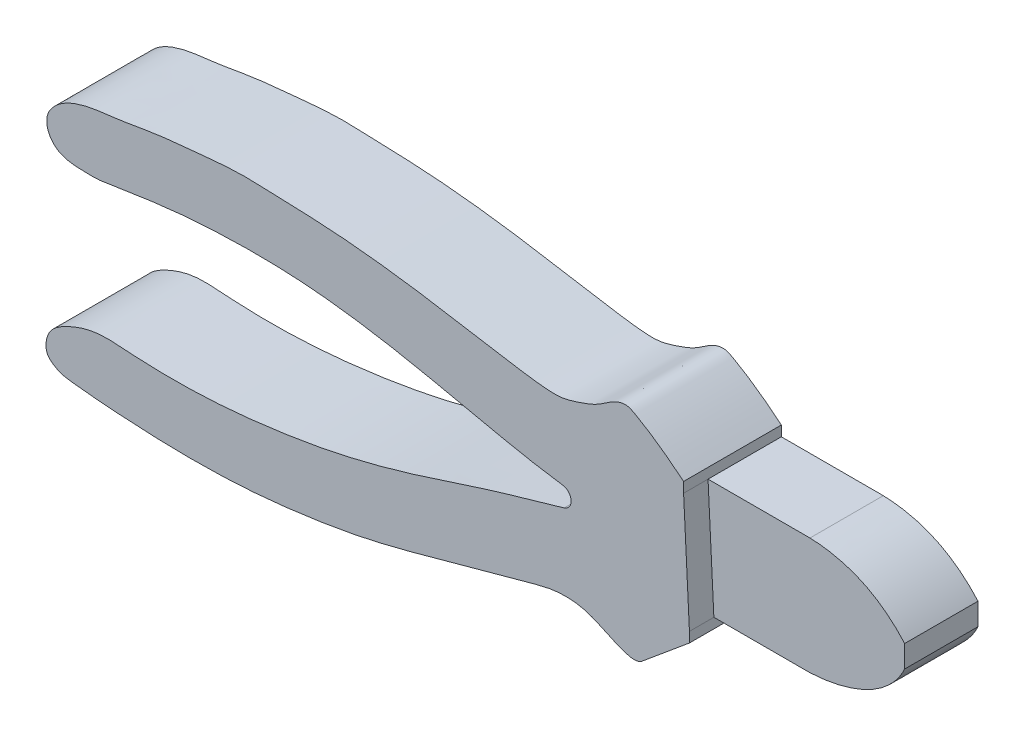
from build123d import *

# Parameters (mm, degrees)
BOSS_EXTRU_1_DEPTH      = 10
BOSS_EXTRU_1_DEPTH_BACK = 10
ENL_V_MAT_EXTRU_1_DEPTH = 5


with BuildPart() as part:
    # Esquisse1 → Boss.-Extru.1 (new, two sides: drawn at the far end of the back side and taken through both)
    with BuildSketch(Plane.XY.offset(-BOSS_EXTRU_1_DEPTH_BACK)):
        with BuildLine():
            Line((132.369670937, 47.620506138), (132.369670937, 45.525458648))
            Line((132.369670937, 45.525458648), (153.224210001, 45.525458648))
            add(Edge.make_bspline(
                [(153.224210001, 45.525458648), (156.586018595, 45.414954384), (163.94044616, 44.003798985), (169.994484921, 39.484398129), (172.594233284, 36.519074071)],
                knots=[0, 0, 0, 0, 0.46072817, 1, 1, 1, 1], degree=3))
            Line((172.594233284, 36.519074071), (172.594233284, 31.995900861))
            add(Edge.make_bspline(
                [(153.224210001, 21.655507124), (160.55946239, 21.985660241), (169.262082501, 24.838103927), (172.594233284, 31.995900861)],
                knots=[0, 0, 0, 0, 1, 1, 1, 1], degree=3))
            Line((153.224210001, 21.655507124), (133.563656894, 21.655507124))
            Line((133.563656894, 21.655507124), (133.563656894, 19.588906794))
            Line((133.563656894, 19.588906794), (123.607353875, 11.30478142))
            add(Edge.make_bspline(
                [(107.934661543, 30.706470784), (106.614846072, 30.312643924), (102.332494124, 29.016406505), (93.524183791, 26.633161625), (83.107344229, 23.091932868), (71.956682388, 19.641361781), (60.743473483, 16.845305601), (48.019798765, 14.713561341), (33.805204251, 13.333038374), (21.91423254, 13.42768994), (13.945165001, 14.178484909), (10.186760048, 13.543031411), (7.750312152, 12.720020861), (5.228926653, 11.595624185), (2.487064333, 9.630881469), (1.729199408, 6.3478593), (2.357940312, 4.497831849), (4.177243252, 3.429053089), (5.480455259, 2.805776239), (12.320455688, 2.133373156), (14.961602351, 1.889140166), (24.013301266, 1.343434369), (32.260144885, 1.207271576), (42.235295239, 1.436349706), (54.440817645, 2.638630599), (70.17383101, 5.301550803), (85.486352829, 9.797118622), (97.879719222, 13.025499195), (106.006044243, 15.412719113), (113.263001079, 15.117573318), (118.406858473, 11.654858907), (122.568009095, 10.778094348), (123.607353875, 11.30478142)],
                knots=[0.090300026, 0.090300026, 0.090300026, 0.090300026, 0.106405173, 0.142661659, 0.196890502, 0.234993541, 0.279088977, 0.331864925, 0.385692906, 0.445737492, 0.470952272, 0.478530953, 0.490078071, 0.501065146, 0.510206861, 0.515641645, 0.52328441, 0.53149232, 0.539892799, 0.547482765, 0.566071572, 0.60376545, 0.635211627, 0.667445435, 0.718904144, 0.779069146, 0.853448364, 0.905280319, 0.928886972, 0.952276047, 0.987148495, 1, 1, 1, 1], degree=3))
            ThreePointArc((107.934661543, 30.706470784), (109.356715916, 32.778692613), (107.630187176, 34.60501144))
            add(Edge.make_bspline(
                [(107.630187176, 34.60501144), (103.971043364, 35.09867014), (92.953443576, 37.163329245), (75.780755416, 41.245410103), (56.992521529, 44.065613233), (40.867913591, 44.380435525), (27.186583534, 43.476381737), (17.978492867, 42.032873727), (12.376086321, 41.136895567), (9.562252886, 41.235291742), (6.585853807, 41.302282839), (2.660511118, 42.856088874), (1.476469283, 46.262005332), (2.594233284, 48.310836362)],
                knots=[0.173029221, 0.173029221, 0.173029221, 0.173029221, 0.255458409, 0.422604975, 0.567391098, 0.678331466, 0.782021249, 0.872923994, 0.88652138, 0.908394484, 0.935618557, 0.952552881, 1, 1, 1, 1], degree=3))
            add(Edge.make_bspline(
                [(2.594233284, 48.310836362), (3.872862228, 50.498225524), (8.810258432, 53.254279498), (16.63818598, 53.74681031), (24.131849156, 55.272111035), (32.685831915, 56.025614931), (40.783954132, 56.974161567), (49.271401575, 56.499653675), (57.990873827, 56.312032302), (67.976781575, 55.465361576), (79.00486455, 54.007114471), (88.838963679, 52.299870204), (97.35478185, 50.887107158), (103.178659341, 50.021589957), (107.483571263, 49.793205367), (111.076725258, 50.947557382), (114.725193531, 52.226567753), (117.137784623, 54.148771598), (119.218269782, 55.158082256), (120.976889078, 55.393876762), (125.642014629, 52.877842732), (128.995611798, 50.386005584), (132.369670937, 47.620506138)],
                knots=[0, 0, 0, 0, 0.053854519, 0.119644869, 0.17206133, 0.223171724, 0.309727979, 0.352006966, 0.411170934, 0.502927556, 0.573743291, 0.657483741, 0.724014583, 0.764761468, 0.788200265, 0.818463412, 0.847404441, 0.873255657, 0.885924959, 0.898566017, 0.910554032, 1, 1, 1, 1], degree=3))
        make_face()
    extrude(amount=BOSS_EXTRU_1_DEPTH + BOSS_EXTRU_1_DEPTH_BACK)

    # Esquisse2 → Enl_v. mat.-Extru.1 (cut)
    with BuildSketch(Plane.XY.offset(10)):
        with BuildLine():
            Line((133.563656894, 21.655507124), (153.224210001, 21.655507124))
            add(Edge.make_bspline(
                [(153.224210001, 21.655507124), (160.55946239, 21.985660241), (169.262082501, 24.838103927), (172.594233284, 31.995900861)],
                knots=[0, 0, 0, 0, 1, 1, 1, 1], degree=3))
            Line((172.594233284, 31.995900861), (172.594233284, 36.519074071))
            add(Edge.make_bspline(
                [(172.594233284, 36.519074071), (169.994484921, 39.484398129), (163.94044616, 44.003798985), (156.586018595, 45.414954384), (153.224210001, 45.525458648)],
                knots=[0, 0, 0, 0, 0.53927183, 1, 1, 1, 1], degree=3))
            Line((153.224210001, 45.525458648), (132.369670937, 45.525458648))
            Line((132.369670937, 45.525458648), (133.563656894, 21.655507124))
        make_face()
    extrude(amount=-ENL_V_MAT_EXTRU_1_DEPTH, mode=Mode.SUBTRACT)


solid = part.part
